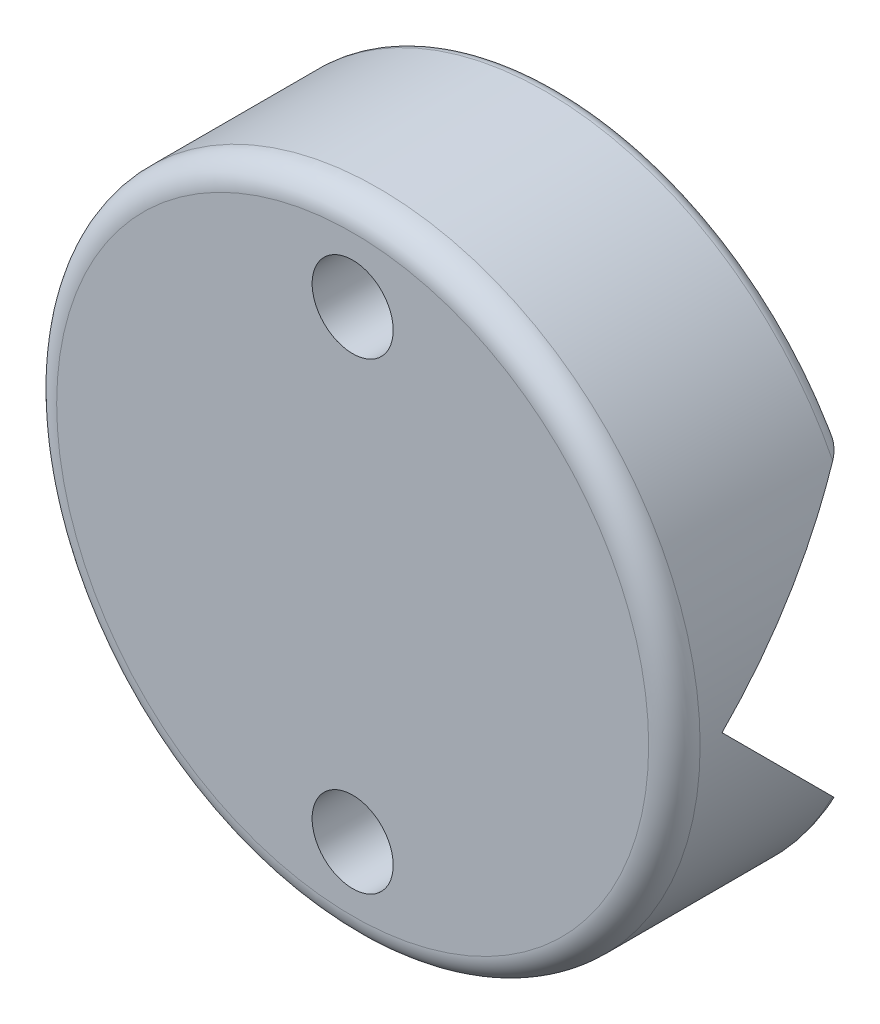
from build123d import *

# Parameters (mm, degrees)
ESQUISSE1_R              = 25
BASE_EXTRUSION_DEPTH     = 16
ESQUISSE6_R              = 3.15
ENL_V_MAT_EXTRU_6_DEPTH  = 39.807215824
ENL_V_MAT_EXTRU_17_DEPTH = 39.807215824
ENL_V_MAT_EXTRU_18_DEPTH = 39.807215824
CONG_1_R                 = 2
CONG_2_R                 = 1


with BuildPart() as part:
    # Esquisse1 → Base-Extrusion (new body)
    with BuildSketch(Plane.XY):
        Circle(ESQUISSE1_R)
    extrude(amount=BASE_EXTRUSION_DEPTH)

    # Esquisse6 → Enl_v. mat.-Extru.6 (cut, through all)
    with BuildSketch(Plane.XY.offset(16)):
        with Locations((0, 18)):
            Circle(ESQUISSE6_R)
        with Locations((0, -18)):
            Circle(ESQUISSE6_R)
    extrude(amount=-ENL_V_MAT_EXTRU_6_DEPTH, mode=Mode.SUBTRACT)

    # Esquisse18 → Enl_v. mat.-Extru.17 (cut, through all)
    with BuildSketch(Plane(origin=(0, 0, 0), x_dir=(0, 0, -1), z_dir=(1, 0, 0))):
        Polygon((0, 12.3), (0, -12.3), (-12.3, 0), align=None)
    extrude(amount=-ENL_V_MAT_EXTRU_17_DEPTH, mode=Mode.SUBTRACT)

    # Esquisse19 → Enl_v. mat.-Extru.18 (cut, through all)
    with BuildSketch(Plane.ZY):
        Polygon((0, 12.3), (12.3, 0), (0, -12.3), align=None)
    extrude(amount=-ENL_V_MAT_EXTRU_18_DEPTH, mode=Mode.SUBTRACT)

    # Cong_1
    cong_1_edges = [part.edges().sort_by_distance(p)[0] for p in [
        (-25, 0, 16),
    ]]
    fillet(cong_1_edges, radius=CONG_1_R)

    # Cong_2
    cong_2_edges = [part.edges().sort_by_distance(p)[0] for p in [
        (0, -25, 0),
        (0, 25, 0),
    ]]
    fillet(cong_2_edges, radius=CONG_2_R)


solid = part.part
